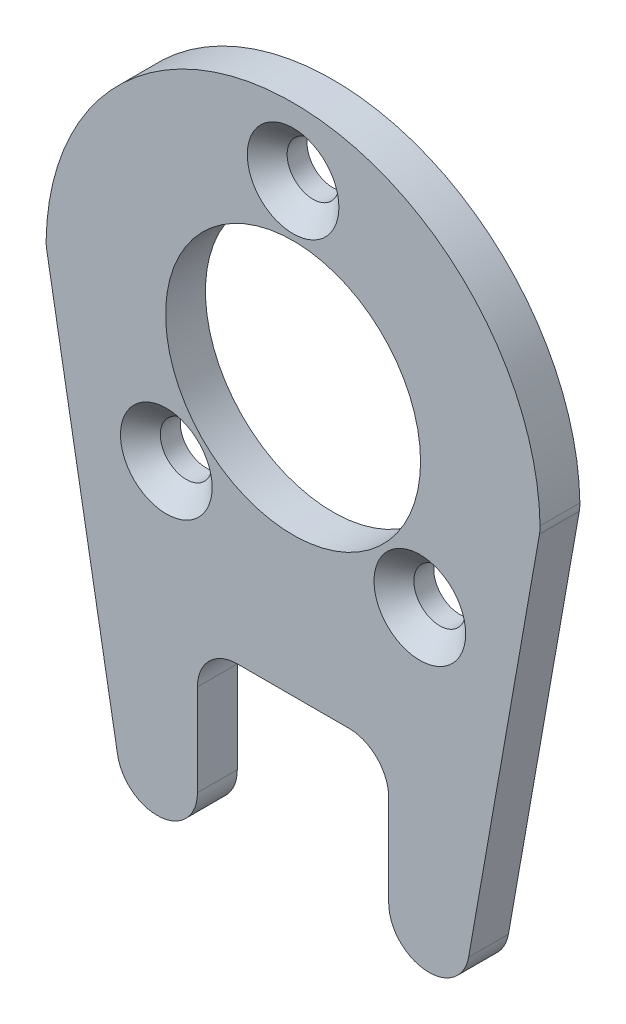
ISO-10303-21;
HEADER;
FILE_DESCRIPTION(('STEP AP214'),'2;1');
FILE_NAME('part.step','',(''),(''),'','','');
FILE_SCHEMA(('AUTOMOTIVE_DESIGN { 1 0 10303 214 1 1 1 1 }'));
ENDSEC;
DATA;
#1=APPLICATION_CONTEXT('core data for automotive mechanical design processes');
#2=APPLICATION_PROTOCOL_DEFINITION('international standard','automotive_design',2000,#1);
#3=PRODUCT_CONTEXT('',#1,'mechanical');
#4=PRODUCT('Part','Part','',(#3));
#5=PRODUCT_RELATED_PRODUCT_CATEGORY('part','',(#4));
#6=PRODUCT_DEFINITION_FORMATION('','',#4);
#7=PRODUCT_DEFINITION_CONTEXT('part definition',#1,'design');
#8=PRODUCT_DEFINITION('design','',#6,#7);
#9=PRODUCT_DEFINITION_SHAPE('','',#8);
#10=(LENGTH_UNIT() NAMED_UNIT(*) SI_UNIT(.MILLI.,.METRE.));
#11=(NAMED_UNIT(*) PLANE_ANGLE_UNIT() SI_UNIT($,.RADIAN.));
#12=(NAMED_UNIT(*) SI_UNIT($,.STERADIAN.) SOLID_ANGLE_UNIT());
#13=UNCERTAINTY_MEASURE_WITH_UNIT(LENGTH_MEASURE(1.E-05),#10,'distance_accuracy_value','');
#14=(GEOMETRIC_REPRESENTATION_CONTEXT(3) GLOBAL_UNCERTAINTY_ASSIGNED_CONTEXT((#13)) GLOBAL_UNIT_ASSIGNED_CONTEXT((#10,
#11,#12)) REPRESENTATION_CONTEXT('',''));
#15=CARTESIAN_POINT('',(0.,0.,0.));
#16=DIRECTION('',(0.,0.,1.));
#17=DIRECTION('',(1.,0.,0.));
#18=AXIS2_PLACEMENT_3D('',#15,#16,#17);
#19=CARTESIAN_POINT('',(25.7226455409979,0.868240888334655,5.));
#20=DIRECTION('',(0.,0.,1.));
#21=DIRECTION('',(1.,0.,0.));
#22=AXIS2_PLACEMENT_3D('',#19,#20,#21);
#23=PLANE('',#22);
#24=CARTESIAN_POINT('',(15.6359141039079,-15.4600155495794,5.));
#25=DIRECTION('',(0.,0.,1.));
#26=DIRECTION('',(1.,0.,0.));
#27=AXIS2_PLACEMENT_3D('',#24,#25,#26);
#28=CIRCLE('',#27,5.75000000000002);
#29=CARTESIAN_POINT('',(21.3859141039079,-15.4600155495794,5.));
#30=VERTEX_POINT('',#29);
#31=EDGE_CURVE('E279',#30,#30,#28,.F.);
#32=ORIENTED_EDGE('',*,*,#31,.T.);
#33=EDGE_LOOP('',(#32));
#34=FACE_BOUND('',#33,.T.);
#35=CARTESIAN_POINT('',(-16.1838910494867,-15.4600155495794,5.));
#36=DIRECTION('',(0.,0.,1.));
#37=DIRECTION('',(1.,0.,0.));
#38=AXIS2_PLACEMENT_3D('',#35,#36,#37);
#39=CIRCLE('',#38,5.75000000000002);
#40=CARTESIAN_POINT('',(-10.4338910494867,-15.4600155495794,5.));
#41=VERTEX_POINT('',#40);
#42=EDGE_CURVE('E276',#41,#41,#39,.F.);
#43=ORIENTED_EDGE('',*,*,#42,.T.);
#44=EDGE_LOOP('',(#43));
#45=FACE_BOUND('',#44,.T.);
#46=CARTESIAN_POINT('',(-0.273988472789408,22.9498870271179,5.));
#47=DIRECTION('',(0.,0.,1.));
#48=DIRECTION('',(1.,0.,0.));
#49=AXIS2_PLACEMENT_3D('',#46,#47,#48);
#50=CIRCLE('',#49,5.75000000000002);
#51=CARTESIAN_POINT('',(5.47601152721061,22.9498870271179,5.));
#52=VERTEX_POINT('',#51);
#53=EDGE_CURVE('E273',#52,#52,#50,.F.);
#54=ORIENTED_EDGE('',*,*,#53,.T.);
#55=EDGE_LOOP('',(#54));
#56=FACE_BOUND('',#55,.T.);
#57=CARTESIAN_POINT('',(-0.273988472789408,0.449887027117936,5.));
#58=DIRECTION('',(0.,0.,1.));
#59=DIRECTION('',(1.,0.,0.));
#60=AXIS2_PLACEMENT_3D('',#57,#58,#59);
#61=CIRCLE('',#60,16.);
#62=CARTESIAN_POINT('',(15.7260115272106,0.449887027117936,5.));
#63=VERTEX_POINT('',#62);
#64=EDGE_CURVE('E167',#63,#63,#61,.T.);
#65=ORIENTED_EDGE('',*,*,#64,.F.);
#66=EDGE_LOOP('',(#65));
#67=FACE_BOUND('',#66,.T.);
#68=CARTESIAN_POINT('',(25.7226455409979,0.868240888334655,5.));
#69=DIRECTION('',(0.,0.,1.));
#70=DIRECTION('',(1.,0.,0.));
#71=AXIS2_PLACEMENT_3D('',#68,#69,#70);
#72=CIRCLE('',#71,5.);
#73=CARTESIAN_POINT('',(30.646684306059,0.,5.));
#74=VERTEX_POINT('',#73);
#75=CARTESIAN_POINT('',(30.721998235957,0.948693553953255,5.));
#76=VERTEX_POINT('',#75);
#77=EDGE_CURVE('E201',#74,#76,#72,.T.);
#78=ORIENTED_EDGE('',*,*,#77,.T.);
#79=CARTESIAN_POINT('',(-0.273988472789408,0.449887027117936,5.));
#80=DIRECTION('',(0.,0.,1.));
#81=DIRECTION('',(1.,0.,0.));
#82=AXIS2_PLACEMENT_3D('',#79,#80,#81);
#83=CIRCLE('',#82,31.);
#84=CARTESIAN_POINT('',(-31.2699751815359,0.948693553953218,5.));
#85=VERTEX_POINT('',#84);
#86=EDGE_CURVE('E159',#76,#85,#83,.T.);
#87=ORIENTED_EDGE('',*,*,#86,.T.);
#88=CARTESIAN_POINT('',(-26.2706224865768,0.868240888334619,5.));
#89=DIRECTION('',(0.,0.,1.));
#90=DIRECTION('',(1.,0.,0.));
#91=AXIS2_PLACEMENT_3D('',#88,#89,#90);
#92=CIRCLE('',#91,5.);
#93=CARTESIAN_POINT('',(-31.1946612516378,0.,5.));
#94=VERTEX_POINT('',#93);
#95=EDGE_CURVE('E204',#85,#94,#92,.T.);
#96=ORIENTED_EDGE('',*,*,#95,.T.);
#97=DIRECTION('',(0.173648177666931,-0.984807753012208,0.));
#98=VECTOR('',#97,1.);
#99=CARTESIAN_POINT('',(-22.3045451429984,-50.4183538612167,5.));
#100=LINE('',#99,#98);
#101=CARTESIAN_POINT('',(-22.3045451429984,-50.4183538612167,5.));
#102=VERTEX_POINT('',#101);
#103=EDGE_CURVE('E206',#94,#102,#100,.T.);
#104=ORIENTED_EDGE('',*,*,#103,.T.);
#105=CARTESIAN_POINT('',(-17.3805063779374,-49.5501129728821,5.));
#106=DIRECTION('',(0.,0.,1.));
#107=DIRECTION('',(1.,0.,0.));
#108=AXIS2_PLACEMENT_3D('',#105,#106,#107);
#109=CIRCLE('',#108,5.00000000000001);
#110=CARTESIAN_POINT('',(-17.3805063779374,-54.5501129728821,5.));
#111=VERTEX_POINT('',#110);
#112=EDGE_CURVE('E208',#102,#111,#109,.T.);
#113=ORIENTED_EDGE('',*,*,#112,.T.);
#114=DIRECTION('',(1.,0.,0.));
#115=VECTOR('',#114,1.);
#116=CARTESIAN_POINT('',(-17.3805063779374,-54.5501129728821,5.));
#117=LINE('',#116,#115);
#118=CARTESIAN_POINT('',(-17.2739884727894,-54.5501129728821,5.));
#119=VERTEX_POINT('',#118);
#120=EDGE_CURVE('E210',#111,#119,#117,.T.);
#121=ORIENTED_EDGE('',*,*,#120,.T.);
#122=CARTESIAN_POINT('',(-17.2739884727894,-49.5501129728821,5.));
#123=DIRECTION('',(0.,0.,1.));
#124=DIRECTION('',(1.,0.,0.));
#125=AXIS2_PLACEMENT_3D('',#122,#123,#124);
#126=CIRCLE('',#125,5.);
#127=CARTESIAN_POINT('',(-12.2739884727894,-49.5501129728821,5.));
#128=VERTEX_POINT('',#127);
#129=EDGE_CURVE('E212',#119,#128,#126,.T.);
#130=ORIENTED_EDGE('',*,*,#129,.T.);
#131=DIRECTION('',(0.,1.,0.));
#132=VECTOR('',#131,1.);
#133=CARTESIAN_POINT('',(-12.2739884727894,-38.0501129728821,5.));
#134=LINE('',#133,#132);
#135=CARTESIAN_POINT('',(-12.2739884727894,-38.0501129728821,5.));
#136=VERTEX_POINT('',#135);
#137=EDGE_CURVE('E214',#128,#136,#134,.T.);
#138=ORIENTED_EDGE('',*,*,#137,.T.);
#139=CARTESIAN_POINT('',(-7.27398847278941,-38.0501129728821,5.));
#140=DIRECTION('',(0.,0.,-1.));
#141=DIRECTION('',(1.,0.,0.));
#142=AXIS2_PLACEMENT_3D('',#139,#140,#141);
#143=CIRCLE('',#142,5.);
#144=CARTESIAN_POINT('',(-7.27398847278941,-33.0501129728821,5.));
#145=VERTEX_POINT('',#144);
#146=EDGE_CURVE('E216',#136,#145,#143,.T.);
#147=ORIENTED_EDGE('',*,*,#146,.T.);
#148=DIRECTION('',(1.,0.,0.));
#149=VECTOR('',#148,1.);
#150=CARTESIAN_POINT('',(6.72601152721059,-33.0501129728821,5.));
#151=LINE('',#150,#149);
#152=CARTESIAN_POINT('',(6.72601152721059,-33.0501129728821,5.));
#153=VERTEX_POINT('',#152);
#154=EDGE_CURVE('E218',#145,#153,#151,.T.);
#155=ORIENTED_EDGE('',*,*,#154,.T.);
#156=CARTESIAN_POINT('',(6.72601152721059,-38.0501129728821,5.));
#157=DIRECTION('',(0.,0.,-1.));
#158=DIRECTION('',(1.,0.,0.));
#159=AXIS2_PLACEMENT_3D('',#156,#157,#158);
#160=CIRCLE('',#159,5.);
#161=CARTESIAN_POINT('',(11.7260115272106,-38.0501129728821,5.));
#162=VERTEX_POINT('',#161);
#163=EDGE_CURVE('E220',#153,#162,#160,.T.);
#164=ORIENTED_EDGE('',*,*,#163,.T.);
#165=DIRECTION('',(0.,-1.,0.));
#166=VECTOR('',#165,1.);
#167=CARTESIAN_POINT('',(11.7260115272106,-49.5501129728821,5.));
#168=LINE('',#167,#166);
#169=CARTESIAN_POINT('',(11.7260115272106,-49.5501129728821,5.));
#170=VERTEX_POINT('',#169);
#171=EDGE_CURVE('E222',#162,#170,#168,.T.);
#172=ORIENTED_EDGE('',*,*,#171,.T.);
#173=CARTESIAN_POINT('',(16.7260115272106,-49.5501129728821,5.));
#174=DIRECTION('',(0.,0.,1.));
#175=DIRECTION('',(1.,0.,0.));
#176=AXIS2_PLACEMENT_3D('',#173,#174,#175);
#177=CIRCLE('',#176,4.99999999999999);
#178=CARTESIAN_POINT('',(16.7260115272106,-54.5501129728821,5.));
#179=VERTEX_POINT('',#178);
#180=EDGE_CURVE('E224',#170,#179,#177,.T.);
#181=ORIENTED_EDGE('',*,*,#180,.T.);
#182=DIRECTION('',(1.,0.,0.));
#183=VECTOR('',#182,1.);
#184=CARTESIAN_POINT('',(16.7260115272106,-54.5501129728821,5.));
#185=LINE('',#184,#183);
#186=CARTESIAN_POINT('',(16.8325294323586,-54.5501129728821,5.));
#187=VERTEX_POINT('',#186);
#188=EDGE_CURVE('E226',#179,#187,#185,.T.);
#189=ORIENTED_EDGE('',*,*,#188,.T.);
#190=CARTESIAN_POINT('',(16.8325294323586,-49.5501129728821,5.));
#191=DIRECTION('',(0.,0.,1.));
#192=DIRECTION('',(1.,0.,0.));
#193=AXIS2_PLACEMENT_3D('',#190,#191,#192);
#194=CIRCLE('',#193,4.99999999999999);
#195=CARTESIAN_POINT('',(21.7565681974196,-50.4183538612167,5.));
#196=VERTEX_POINT('',#195);
#197=EDGE_CURVE('E50',#187,#196,#194,.T.);
#198=ORIENTED_EDGE('',*,*,#197,.T.);
#199=DIRECTION('',(0.173648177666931,0.984807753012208,0.));
#200=VECTOR('',#199,1.);
#201=CARTESIAN_POINT('',(30.646684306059,0.,5.));
#202=LINE('',#201,#200);
#203=EDGE_CURVE('E45',#196,#74,#202,.T.);
#204=ORIENTED_EDGE('',*,*,#203,.T.);
#205=EDGE_LOOP('',(#78,#87,#96,#104,#113,#121,#130,#138,#147,#155,#164,#172,#181,#189,#198,#204));
#206=FACE_BOUND('',#205,.T.);
#207=ADVANCED_FACE('F30',(#34,#45,#56,#67,#206),#23,.T.);
#208=CARTESIAN_POINT('',(25.7226455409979,0.868240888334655,0.));
#209=DIRECTION('',(0.,0.,1.));
#210=DIRECTION('',(1.,0.,0.));
#211=AXIS2_PLACEMENT_3D('',#208,#209,#210);
#212=PLANE('',#211);
#213=CARTESIAN_POINT('',(-16.1838910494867,-15.4600155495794,0.));
#214=DIRECTION('',(0.,0.,1.));
#215=DIRECTION('',(1.,0.,0.));
#216=AXIS2_PLACEMENT_3D('',#213,#214,#215);
#217=CIRCLE('',#216,3.25);
#218=CARTESIAN_POINT('',(-12.9338910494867,-15.4600155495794,0.));
#219=VERTEX_POINT('',#218);
#220=EDGE_CURVE('E534',#219,#219,#217,.T.);
#221=ORIENTED_EDGE('',*,*,#220,.T.);
#222=EDGE_LOOP('',(#221));
#223=FACE_BOUND('',#222,.T.);
#224=CARTESIAN_POINT('',(-0.273988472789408,0.449887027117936,0.));
#225=DIRECTION('',(0.,0.,1.));
#226=DIRECTION('',(1.,0.,0.));
#227=AXIS2_PLACEMENT_3D('',#224,#225,#226);
#228=CIRCLE('',#227,16.);
#229=CARTESIAN_POINT('',(15.7260115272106,0.449887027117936,0.));
#230=VERTEX_POINT('',#229);
#231=EDGE_CURVE('E170',#230,#230,#228,.T.);
#232=ORIENTED_EDGE('',*,*,#231,.T.);
#233=EDGE_LOOP('',(#232));
#234=FACE_BOUND('',#233,.T.);
#235=CARTESIAN_POINT('',(25.7226455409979,0.868240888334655,0.));
#236=DIRECTION('',(0.,0.,1.));
#237=DIRECTION('',(1.,0.,0.));
#238=AXIS2_PLACEMENT_3D('',#235,#236,#237);
#239=CIRCLE('',#238,5.);
#240=CARTESIAN_POINT('',(30.646684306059,0.,0.));
#241=VERTEX_POINT('',#240);
#242=CARTESIAN_POINT('',(30.721998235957,0.948693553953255,0.));
#243=VERTEX_POINT('',#242);
#244=EDGE_CURVE('E149',#241,#243,#239,.T.);
#245=ORIENTED_EDGE('',*,*,#244,.F.);
#246=DIRECTION('',(0.173648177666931,0.984807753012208,0.));
#247=VECTOR('',#246,1.);
#248=CARTESIAN_POINT('',(30.646684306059,0.,0.));
#249=LINE('',#248,#247);
#250=CARTESIAN_POINT('',(21.7565681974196,-50.4183538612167,0.));
#251=VERTEX_POINT('',#250);
#252=EDGE_CURVE('E199',#251,#241,#249,.T.);
#253=ORIENTED_EDGE('',*,*,#252,.F.);
#254=CARTESIAN_POINT('',(16.8325294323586,-49.5501129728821,0.));
#255=DIRECTION('',(0.,0.,1.));
#256=DIRECTION('',(1.,0.,0.));
#257=AXIS2_PLACEMENT_3D('',#254,#255,#256);
#258=CIRCLE('',#257,4.99999999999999);
#259=CARTESIAN_POINT('',(16.8325294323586,-54.5501129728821,0.));
#260=VERTEX_POINT('',#259);
#261=EDGE_CURVE('E197',#260,#251,#258,.T.);
#262=ORIENTED_EDGE('',*,*,#261,.F.);
#263=DIRECTION('',(1.,0.,0.));
#264=VECTOR('',#263,1.);
#265=CARTESIAN_POINT('',(16.7260115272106,-54.5501129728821,0.));
#266=LINE('',#265,#264);
#267=CARTESIAN_POINT('',(16.7260115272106,-54.5501129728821,0.));
#268=VERTEX_POINT('',#267);
#269=EDGE_CURVE('E195',#268,#260,#266,.T.);
#270=ORIENTED_EDGE('',*,*,#269,.F.);
#271=CARTESIAN_POINT('',(16.7260115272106,-49.5501129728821,0.));
#272=DIRECTION('',(0.,0.,1.));
#273=DIRECTION('',(1.,0.,0.));
#274=AXIS2_PLACEMENT_3D('',#271,#272,#273);
#275=CIRCLE('',#274,4.99999999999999);
#276=CARTESIAN_POINT('',(11.7260115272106,-49.5501129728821,0.));
#277=VERTEX_POINT('',#276);
#278=EDGE_CURVE('E193',#277,#268,#275,.T.);
#279=ORIENTED_EDGE('',*,*,#278,.F.);
#280=DIRECTION('',(0.,-1.,0.));
#281=VECTOR('',#280,1.);
#282=CARTESIAN_POINT('',(11.7260115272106,-49.5501129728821,0.));
#283=LINE('',#282,#281);
#284=CARTESIAN_POINT('',(11.7260115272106,-38.0501129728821,0.));
#285=VERTEX_POINT('',#284);
#286=EDGE_CURVE('E191',#285,#277,#283,.T.);
#287=ORIENTED_EDGE('',*,*,#286,.F.);
#288=CARTESIAN_POINT('',(6.72601152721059,-38.0501129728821,0.));
#289=DIRECTION('',(0.,0.,-1.));
#290=DIRECTION('',(1.,0.,0.));
#291=AXIS2_PLACEMENT_3D('',#288,#289,#290);
#292=CIRCLE('',#291,5.);
#293=CARTESIAN_POINT('',(6.72601152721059,-33.0501129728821,0.));
#294=VERTEX_POINT('',#293);
#295=EDGE_CURVE('E189',#294,#285,#292,.T.);
#296=ORIENTED_EDGE('',*,*,#295,.F.);
#297=DIRECTION('',(1.,0.,0.));
#298=VECTOR('',#297,1.);
#299=CARTESIAN_POINT('',(6.72601152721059,-33.0501129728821,0.));
#300=LINE('',#299,#298);
#301=CARTESIAN_POINT('',(-7.27398847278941,-33.0501129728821,0.));
#302=VERTEX_POINT('',#301);
#303=EDGE_CURVE('E187',#302,#294,#300,.T.);
#304=ORIENTED_EDGE('',*,*,#303,.F.);
#305=CARTESIAN_POINT('',(-7.27398847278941,-38.0501129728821,0.));
#306=DIRECTION('',(0.,0.,-1.));
#307=DIRECTION('',(1.,0.,0.));
#308=AXIS2_PLACEMENT_3D('',#305,#306,#307);
#309=CIRCLE('',#308,5.);
#310=CARTESIAN_POINT('',(-12.2739884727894,-38.0501129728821,0.));
#311=VERTEX_POINT('',#310);
#312=EDGE_CURVE('E185',#311,#302,#309,.T.);
#313=ORIENTED_EDGE('',*,*,#312,.F.);
#314=DIRECTION('',(0.,1.,0.));
#315=VECTOR('',#314,1.);
#316=CARTESIAN_POINT('',(-12.2739884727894,-38.0501129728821,0.));
#317=LINE('',#316,#315);
#318=CARTESIAN_POINT('',(-12.2739884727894,-49.5501129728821,0.));
#319=VERTEX_POINT('',#318);
#320=EDGE_CURVE('E183',#319,#311,#317,.T.);
#321=ORIENTED_EDGE('',*,*,#320,.F.);
#322=CARTESIAN_POINT('',(-17.2739884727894,-49.5501129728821,0.));
#323=DIRECTION('',(0.,0.,1.));
#324=DIRECTION('',(1.,0.,0.));
#325=AXIS2_PLACEMENT_3D('',#322,#323,#324);
#326=CIRCLE('',#325,5.);
#327=CARTESIAN_POINT('',(-17.2739884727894,-54.5501129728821,0.));
#328=VERTEX_POINT('',#327);
#329=EDGE_CURVE('E181',#328,#319,#326,.T.);
#330=ORIENTED_EDGE('',*,*,#329,.F.);
#331=DIRECTION('',(1.,0.,0.));
#332=VECTOR('',#331,1.);
#333=CARTESIAN_POINT('',(-17.3805063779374,-54.5501129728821,0.));
#334=LINE('',#333,#332);
#335=CARTESIAN_POINT('',(-17.3805063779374,-54.5501129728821,0.));
#336=VERTEX_POINT('',#335);
#337=EDGE_CURVE('E179',#336,#328,#334,.T.);
#338=ORIENTED_EDGE('',*,*,#337,.F.);
#339=CARTESIAN_POINT('',(-17.3805063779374,-49.5501129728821,0.));
#340=DIRECTION('',(0.,0.,1.));
#341=DIRECTION('',(1.,0.,0.));
#342=AXIS2_PLACEMENT_3D('',#339,#340,#341);
#343=CIRCLE('',#342,5.00000000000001);
#344=CARTESIAN_POINT('',(-22.3045451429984,-50.4183538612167,0.));
#345=VERTEX_POINT('',#344);
#346=EDGE_CURVE('E177',#345,#336,#343,.T.);
#347=ORIENTED_EDGE('',*,*,#346,.F.);
#348=DIRECTION('',(0.173648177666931,-0.984807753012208,0.));
#349=VECTOR('',#348,1.);
#350=CARTESIAN_POINT('',(-22.3045451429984,-50.4183538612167,0.));
#351=LINE('',#350,#349);
#352=CARTESIAN_POINT('',(-31.1946612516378,0.,0.));
#353=VERTEX_POINT('',#352);
#354=EDGE_CURVE('E175',#353,#345,#351,.T.);
#355=ORIENTED_EDGE('',*,*,#354,.F.);
#356=CARTESIAN_POINT('',(-26.2706224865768,0.868240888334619,0.));
#357=DIRECTION('',(0.,0.,1.));
#358=DIRECTION('',(1.,0.,0.));
#359=AXIS2_PLACEMENT_3D('',#356,#357,#358);
#360=CIRCLE('',#359,5.);
#361=CARTESIAN_POINT('',(-31.2699751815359,0.948693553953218,0.));
#362=VERTEX_POINT('',#361);
#363=EDGE_CURVE('E151',#362,#353,#360,.T.);
#364=ORIENTED_EDGE('',*,*,#363,.F.);
#365=CARTESIAN_POINT('',(-0.273988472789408,0.449887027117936,0.));
#366=DIRECTION('',(0.,0.,1.));
#367=DIRECTION('',(1.,0.,0.));
#368=AXIS2_PLACEMENT_3D('',#365,#366,#367);
#369=CIRCLE('',#368,31.);
#370=EDGE_CURVE('E143',#243,#362,#369,.T.);
#371=ORIENTED_EDGE('',*,*,#370,.F.);
#372=EDGE_LOOP('',(#245,#253,#262,#270,#279,#287,#296,#304,#313,#321,#330,#338,#347,#355,#364,#371));
#373=FACE_BOUND('',#372,.T.);
#374=CARTESIAN_POINT('',(-0.273988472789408,22.9498870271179,0.));
#375=DIRECTION('',(0.,0.,1.));
#376=DIRECTION('',(1.,0.,0.));
#377=AXIS2_PLACEMENT_3D('',#374,#375,#376);
#378=CIRCLE('',#377,3.25);
#379=CARTESIAN_POINT('',(2.97601152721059,22.9498870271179,0.));
#380=VERTEX_POINT('',#379);
#381=EDGE_CURVE('E537',#380,#380,#378,.T.);
#382=ORIENTED_EDGE('',*,*,#381,.T.);
#383=EDGE_LOOP('',(#382));
#384=FACE_BOUND('',#383,.T.);
#385=CARTESIAN_POINT('',(15.6359141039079,-15.4600155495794,0.));
#386=DIRECTION('',(0.,0.,1.));
#387=DIRECTION('',(1.,0.,0.));
#388=AXIS2_PLACEMENT_3D('',#385,#386,#387);
#389=CIRCLE('',#388,3.25);
#390=CARTESIAN_POINT('',(18.8859141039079,-15.4600155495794,0.));
#391=VERTEX_POINT('',#390);
#392=EDGE_CURVE('E532',#391,#391,#389,.T.);
#393=ORIENTED_EDGE('',*,*,#392,.T.);
#394=EDGE_LOOP('',(#393));
#395=FACE_BOUND('',#394,.T.);
#396=ADVANCED_FACE('F145',(#223,#234,#373,#384,#395),#212,.F.);
#397=CARTESIAN_POINT('',(25.7226455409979,0.868240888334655,5.));
#398=DIRECTION('',(0.,0.,-1.));
#399=DIRECTION('',(-1.,0.,0.));
#400=AXIS2_PLACEMENT_3D('',#397,#398,#399);
#401=CYLINDRICAL_SURFACE('',#400,5.);
#402=ORIENTED_EDGE('',*,*,#244,.T.);
#403=DIRECTION('',(0.,0.,-1.));
#404=VECTOR('',#403,1.);
#405=CARTESIAN_POINT('',(30.721998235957,0.948693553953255,5.));
#406=LINE('',#405,#404);
#407=EDGE_CURVE('E157',#76,#243,#406,.T.);
#408=ORIENTED_EDGE('',*,*,#407,.F.);
#409=ORIENTED_EDGE('',*,*,#77,.F.);
#410=DIRECTION('',(0.,0.,-1.));
#411=VECTOR('',#410,1.);
#412=CARTESIAN_POINT('',(30.646684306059,0.,5.));
#413=LINE('',#412,#411);
#414=EDGE_CURVE('E166',#74,#241,#413,.T.);
#415=ORIENTED_EDGE('',*,*,#414,.T.);
#416=EDGE_LOOP('',(#402,#408,#409,#415));
#417=FACE_BOUND('',#416,.T.);
#418=ADVANCED_FACE('F32',(#417),#401,.T.);
#419=CARTESIAN_POINT('',(-0.273988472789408,0.449887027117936,5.));
#420=DIRECTION('',(0.,0.,-1.));
#421=DIRECTION('',(-1.,0.,0.));
#422=AXIS2_PLACEMENT_3D('',#419,#420,#421);
#423=CYLINDRICAL_SURFACE('',#422,31.);
#424=ORIENTED_EDGE('',*,*,#370,.T.);
#425=DIRECTION('',(0.,0.,-1.));
#426=VECTOR('',#425,1.);
#427=CARTESIAN_POINT('',(-31.2699751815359,0.948693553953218,5.));
#428=LINE('',#427,#426);
#429=EDGE_CURVE('E163',#85,#362,#428,.T.);
#430=ORIENTED_EDGE('',*,*,#429,.F.);
#431=ORIENTED_EDGE('',*,*,#86,.F.);
#432=ORIENTED_EDGE('',*,*,#407,.T.);
#433=EDGE_LOOP('',(#424,#430,#431,#432));
#434=FACE_BOUND('',#433,.T.);
#435=ADVANCED_FACE('F158',(#434),#423,.T.);
#436=CARTESIAN_POINT('',(-26.2706224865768,0.868240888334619,5.));
#437=DIRECTION('',(0.,0.,-1.));
#438=DIRECTION('',(-1.,0.,0.));
#439=AXIS2_PLACEMENT_3D('',#436,#437,#438);
#440=CYLINDRICAL_SURFACE('',#439,5.);
#441=ORIENTED_EDGE('',*,*,#363,.T.);
#442=DIRECTION('',(0.,0.,-1.));
#443=VECTOR('',#442,1.);
#444=CARTESIAN_POINT('',(-31.1946612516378,0.,5.));
#445=LINE('',#444,#443);
#446=EDGE_CURVE('E267',#94,#353,#445,.T.);
#447=ORIENTED_EDGE('',*,*,#446,.F.);
#448=ORIENTED_EDGE('',*,*,#95,.F.);
#449=ORIENTED_EDGE('',*,*,#429,.T.);
#450=EDGE_LOOP('',(#441,#447,#448,#449));
#451=FACE_BOUND('',#450,.T.);
#452=ADVANCED_FACE('F366',(#451),#440,.T.);
#453=CARTESIAN_POINT('',(-22.3045451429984,-50.4183538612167,5.));
#454=DIRECTION('',(0.984807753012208,0.173648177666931,0.));
#455=DIRECTION('',(-0.173648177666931,0.984807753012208,0.));
#456=AXIS2_PLACEMENT_3D('',#453,#454,#455);
#457=PLANE('',#456);
#458=ORIENTED_EDGE('',*,*,#354,.T.);
#459=DIRECTION('',(0.,0.,-1.));
#460=VECTOR('',#459,1.);
#461=CARTESIAN_POINT('',(-22.3045451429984,-50.4183538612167,5.));
#462=LINE('',#461,#460);
#463=EDGE_CURVE('E264',#102,#345,#462,.T.);
#464=ORIENTED_EDGE('',*,*,#463,.F.);
#465=ORIENTED_EDGE('',*,*,#103,.F.);
#466=ORIENTED_EDGE('',*,*,#446,.T.);
#467=EDGE_LOOP('',(#458,#464,#465,#466));
#468=FACE_BOUND('',#467,.T.);
#469=ADVANCED_FACE('F362',(#468),#457,.F.);
#470=CARTESIAN_POINT('',(-17.3805063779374,-49.5501129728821,5.));
#471=DIRECTION('',(0.,0.,-1.));
#472=DIRECTION('',(-1.,0.,0.));
#473=AXIS2_PLACEMENT_3D('',#470,#471,#472);
#474=CYLINDRICAL_SURFACE('',#473,5.00000000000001);
#475=ORIENTED_EDGE('',*,*,#346,.T.);
#476=DIRECTION('',(0.,0.,-1.));
#477=VECTOR('',#476,1.);
#478=CARTESIAN_POINT('',(-17.3805063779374,-54.5501129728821,5.));
#479=LINE('',#478,#477);
#480=EDGE_CURVE('E261',#111,#336,#479,.T.);
#481=ORIENTED_EDGE('',*,*,#480,.F.);
#482=ORIENTED_EDGE('',*,*,#112,.F.);
#483=ORIENTED_EDGE('',*,*,#463,.T.);
#484=EDGE_LOOP('',(#475,#481,#482,#483));
#485=FACE_BOUND('',#484,.T.);
#486=ADVANCED_FACE('F358',(#485),#474,.T.);
#487=CARTESIAN_POINT('',(-17.3805063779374,-54.5501129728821,5.));
#488=DIRECTION('',(0.,1.,0.));
#489=DIRECTION('',(0.,0.,1.));
#490=AXIS2_PLACEMENT_3D('',#487,#488,#489);
#491=PLANE('',#490);
#492=ORIENTED_EDGE('',*,*,#337,.T.);
#493=DIRECTION('',(0.,0.,-1.));
#494=VECTOR('',#493,1.);
#495=CARTESIAN_POINT('',(-17.2739884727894,-54.5501129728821,5.));
#496=LINE('',#495,#494);
#497=EDGE_CURVE('E258',#119,#328,#496,.T.);
#498=ORIENTED_EDGE('',*,*,#497,.F.);
#499=ORIENTED_EDGE('',*,*,#120,.F.);
#500=ORIENTED_EDGE('',*,*,#480,.T.);
#501=EDGE_LOOP('',(#492,#498,#499,#500));
#502=FACE_BOUND('',#501,.T.);
#503=ADVANCED_FACE('F354',(#502),#491,.F.);
#504=CARTESIAN_POINT('',(-17.2739884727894,-49.5501129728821,5.));
#505=DIRECTION('',(0.,0.,-1.));
#506=DIRECTION('',(-1.,0.,0.));
#507=AXIS2_PLACEMENT_3D('',#504,#505,#506);
#508=CYLINDRICAL_SURFACE('',#507,5.);
#509=ORIENTED_EDGE('',*,*,#329,.T.);
#510=DIRECTION('',(0.,0.,-1.));
#511=VECTOR('',#510,1.);
#512=CARTESIAN_POINT('',(-12.2739884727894,-49.5501129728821,5.));
#513=LINE('',#512,#511);
#514=EDGE_CURVE('E255',#128,#319,#513,.T.);
#515=ORIENTED_EDGE('',*,*,#514,.F.);
#516=ORIENTED_EDGE('',*,*,#129,.F.);
#517=ORIENTED_EDGE('',*,*,#497,.T.);
#518=EDGE_LOOP('',(#509,#515,#516,#517));
#519=FACE_BOUND('',#518,.T.);
#520=ADVANCED_FACE('F350',(#519),#508,.T.);
#521=CARTESIAN_POINT('',(-12.2739884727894,-38.0501129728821,5.));
#522=DIRECTION('',(-1.,0.,0.));
#523=DIRECTION('',(0.,-1.,0.));
#524=AXIS2_PLACEMENT_3D('',#521,#522,#523);
#525=PLANE('',#524);
#526=ORIENTED_EDGE('',*,*,#320,.T.);
#527=DIRECTION('',(0.,0.,-1.));
#528=VECTOR('',#527,1.);
#529=CARTESIAN_POINT('',(-12.2739884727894,-38.0501129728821,5.));
#530=LINE('',#529,#528);
#531=EDGE_CURVE('E252',#136,#311,#530,.T.);
#532=ORIENTED_EDGE('',*,*,#531,.F.);
#533=ORIENTED_EDGE('',*,*,#137,.F.);
#534=ORIENTED_EDGE('',*,*,#514,.T.);
#535=EDGE_LOOP('',(#526,#532,#533,#534));
#536=FACE_BOUND('',#535,.T.);
#537=ADVANCED_FACE('F346',(#536),#525,.F.);
#538=CARTESIAN_POINT('',(-7.27398847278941,-38.0501129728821,5.));
#539=DIRECTION('',(0.,0.,-1.));
#540=DIRECTION('',(-1.,0.,0.));
#541=AXIS2_PLACEMENT_3D('',#538,#539,#540);
#542=CYLINDRICAL_SURFACE('',#541,5.);
#543=ORIENTED_EDGE('',*,*,#312,.T.);
#544=DIRECTION('',(0.,0.,-1.));
#545=VECTOR('',#544,1.);
#546=CARTESIAN_POINT('',(-7.27398847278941,-33.0501129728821,5.));
#547=LINE('',#546,#545);
#548=EDGE_CURVE('E249',#145,#302,#547,.T.);
#549=ORIENTED_EDGE('',*,*,#548,.F.);
#550=ORIENTED_EDGE('',*,*,#146,.F.);
#551=ORIENTED_EDGE('',*,*,#531,.T.);
#552=EDGE_LOOP('',(#543,#549,#550,#551));
#553=FACE_BOUND('',#552,.T.);
#554=ADVANCED_FACE('F342',(#553),#542,.F.);
#555=CARTESIAN_POINT('',(6.72601152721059,-33.0501129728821,5.));
#556=DIRECTION('',(0.,1.,0.));
#557=DIRECTION('',(0.,0.,1.));
#558=AXIS2_PLACEMENT_3D('',#555,#556,#557);
#559=PLANE('',#558);
#560=ORIENTED_EDGE('',*,*,#303,.T.);
#561=DIRECTION('',(0.,0.,-1.));
#562=VECTOR('',#561,1.);
#563=CARTESIAN_POINT('',(6.72601152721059,-33.0501129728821,5.));
#564=LINE('',#563,#562);
#565=EDGE_CURVE('E246',#153,#294,#564,.T.);
#566=ORIENTED_EDGE('',*,*,#565,.F.);
#567=ORIENTED_EDGE('',*,*,#154,.F.);
#568=ORIENTED_EDGE('',*,*,#548,.T.);
#569=EDGE_LOOP('',(#560,#566,#567,#568));
#570=FACE_BOUND('',#569,.T.);
#571=ADVANCED_FACE('F338',(#570),#559,.F.);
#572=CARTESIAN_POINT('',(6.72601152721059,-38.0501129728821,5.));
#573=DIRECTION('',(0.,0.,-1.));
#574=DIRECTION('',(-1.,0.,0.));
#575=AXIS2_PLACEMENT_3D('',#572,#573,#574);
#576=CYLINDRICAL_SURFACE('',#575,5.);
#577=ORIENTED_EDGE('',*,*,#295,.T.);
#578=DIRECTION('',(0.,0.,-1.));
#579=VECTOR('',#578,1.);
#580=CARTESIAN_POINT('',(11.7260115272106,-38.0501129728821,5.));
#581=LINE('',#580,#579);
#582=EDGE_CURVE('E243',#162,#285,#581,.T.);
#583=ORIENTED_EDGE('',*,*,#582,.F.);
#584=ORIENTED_EDGE('',*,*,#163,.F.);
#585=ORIENTED_EDGE('',*,*,#565,.T.);
#586=EDGE_LOOP('',(#577,#583,#584,#585));
#587=FACE_BOUND('',#586,.T.);
#588=ADVANCED_FACE('F334',(#587),#576,.F.);
#589=CARTESIAN_POINT('',(11.7260115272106,-49.5501129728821,5.));
#590=DIRECTION('',(1.,0.,0.));
#591=DIRECTION('',(0.,1.,0.));
#592=AXIS2_PLACEMENT_3D('',#589,#590,#591);
#593=PLANE('',#592);
#594=ORIENTED_EDGE('',*,*,#286,.T.);
#595=DIRECTION('',(0.,0.,-1.));
#596=VECTOR('',#595,1.);
#597=CARTESIAN_POINT('',(11.7260115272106,-49.5501129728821,5.));
#598=LINE('',#597,#596);
#599=EDGE_CURVE('E240',#170,#277,#598,.T.);
#600=ORIENTED_EDGE('',*,*,#599,.F.);
#601=ORIENTED_EDGE('',*,*,#171,.F.);
#602=ORIENTED_EDGE('',*,*,#582,.T.);
#603=EDGE_LOOP('',(#594,#600,#601,#602));
#604=FACE_BOUND('',#603,.T.);
#605=ADVANCED_FACE('F330',(#604),#593,.F.);
#606=CARTESIAN_POINT('',(16.7260115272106,-49.5501129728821,5.));
#607=DIRECTION('',(0.,0.,-1.));
#608=DIRECTION('',(-1.,0.,0.));
#609=AXIS2_PLACEMENT_3D('',#606,#607,#608);
#610=CYLINDRICAL_SURFACE('',#609,4.99999999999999);
#611=ORIENTED_EDGE('',*,*,#278,.T.);
#612=DIRECTION('',(0.,0.,-1.));
#613=VECTOR('',#612,1.);
#614=CARTESIAN_POINT('',(16.7260115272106,-54.5501129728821,5.));
#615=LINE('',#614,#613);
#616=EDGE_CURVE('E237',#179,#268,#615,.T.);
#617=ORIENTED_EDGE('',*,*,#616,.F.);
#618=ORIENTED_EDGE('',*,*,#180,.F.);
#619=ORIENTED_EDGE('',*,*,#599,.T.);
#620=EDGE_LOOP('',(#611,#617,#618,#619));
#621=FACE_BOUND('',#620,.T.);
#622=ADVANCED_FACE('F326',(#621),#610,.T.);
#623=CARTESIAN_POINT('',(16.7260115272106,-54.5501129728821,5.));
#624=DIRECTION('',(0.,1.,0.));
#625=DIRECTION('',(0.,0.,1.));
#626=AXIS2_PLACEMENT_3D('',#623,#624,#625);
#627=PLANE('',#626);
#628=ORIENTED_EDGE('',*,*,#269,.T.);
#629=DIRECTION('',(0.,0.,-1.));
#630=VECTOR('',#629,1.);
#631=CARTESIAN_POINT('',(16.8325294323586,-54.5501129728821,5.));
#632=LINE('',#631,#630);
#633=EDGE_CURVE('E234',#187,#260,#632,.T.);
#634=ORIENTED_EDGE('',*,*,#633,.F.);
#635=ORIENTED_EDGE('',*,*,#188,.F.);
#636=ORIENTED_EDGE('',*,*,#616,.T.);
#637=EDGE_LOOP('',(#628,#634,#635,#636));
#638=FACE_BOUND('',#637,.T.);
#639=ADVANCED_FACE('F322',(#638),#627,.F.);
#640=CARTESIAN_POINT('',(16.8325294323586,-49.5501129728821,5.));
#641=DIRECTION('',(0.,0.,-1.));
#642=DIRECTION('',(-1.,0.,0.));
#643=AXIS2_PLACEMENT_3D('',#640,#641,#642);
#644=CYLINDRICAL_SURFACE('',#643,4.99999999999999);
#645=ORIENTED_EDGE('',*,*,#261,.T.);
#646=DIRECTION('',(0.,0.,-1.));
#647=VECTOR('',#646,1.);
#648=CARTESIAN_POINT('',(21.7565681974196,-50.4183538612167,5.));
#649=LINE('',#648,#647);
#650=EDGE_CURVE('E231',#196,#251,#649,.T.);
#651=ORIENTED_EDGE('',*,*,#650,.F.);
#652=ORIENTED_EDGE('',*,*,#197,.F.);
#653=ORIENTED_EDGE('',*,*,#633,.T.);
#654=EDGE_LOOP('',(#645,#651,#652,#653));
#655=FACE_BOUND('',#654,.T.);
#656=ADVANCED_FACE('F318',(#655),#644,.T.);
#657=CARTESIAN_POINT('',(30.646684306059,0.,5.));
#658=DIRECTION('',(-0.984807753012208,0.173648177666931,0.));
#659=DIRECTION('',(-0.173648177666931,-0.984807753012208,0.));
#660=AXIS2_PLACEMENT_3D('',#657,#658,#659);
#661=PLANE('',#660);
#662=ORIENTED_EDGE('',*,*,#252,.T.);
#663=ORIENTED_EDGE('',*,*,#414,.F.);
#664=ORIENTED_EDGE('',*,*,#203,.F.);
#665=ORIENTED_EDGE('',*,*,#650,.T.);
#666=EDGE_LOOP('',(#662,#663,#664,#665));
#667=FACE_BOUND('',#666,.T.);
#668=ADVANCED_FACE('F314',(#667),#661,.F.);
#669=CARTESIAN_POINT('',(-0.273988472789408,0.449887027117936,5.));
#670=DIRECTION('',(0.,0.,-1.));
#671=DIRECTION('',(-1.,0.,0.));
#672=AXIS2_PLACEMENT_3D('',#669,#670,#671);
#673=CYLINDRICAL_SURFACE('',#672,16.);
#674=ORIENTED_EDGE('',*,*,#64,.T.);
#675=EDGE_LOOP('',(#674));
#676=FACE_BOUND('',#675,.T.);
#677=ORIENTED_EDGE('',*,*,#231,.F.);
#678=EDGE_LOOP('',(#677));
#679=FACE_BOUND('',#678,.T.);
#680=ADVANCED_FACE('F317',(#676,#679),#673,.F.);
#681=CARTESIAN_POINT('',(-0.273988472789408,22.9498870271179,5.));
#682=DIRECTION('',(0.,0.,-1.));
#683=DIRECTION('',(-1.,0.,0.));
#684=AXIS2_PLACEMENT_3D('',#681,#682,#683);
#685=CYLINDRICAL_SURFACE('',#684,3.25);
#686=CARTESIAN_POINT('',(-0.273988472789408,22.9498870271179,2.49999999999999));
#687=DIRECTION('',(0.,0.,1.));
#688=DIRECTION('',(1.,0.,0.));
#689=AXIS2_PLACEMENT_3D('',#686,#687,#688);
#690=CIRCLE('',#689,3.25);
#691=CARTESIAN_POINT('',(2.97601152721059,22.9498870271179,2.49999999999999));
#692=VERTEX_POINT('',#691);
#693=EDGE_CURVE('E11',#692,#692,#690,.T.);
#694=ORIENTED_EDGE('',*,*,#693,.T.);
#695=EDGE_LOOP('',(#694));
#696=FACE_BOUND('',#695,.T.);
#697=ORIENTED_EDGE('',*,*,#381,.F.);
#698=EDGE_LOOP('',(#697));
#699=FACE_BOUND('',#698,.T.);
#700=ADVANCED_FACE('F469',(#696,#699),#685,.F.);
#701=CARTESIAN_POINT('',(-16.1838910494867,-15.4600155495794,5.));
#702=DIRECTION('',(0.,0.,-1.));
#703=DIRECTION('',(-1.,0.,0.));
#704=AXIS2_PLACEMENT_3D('',#701,#702,#703);
#705=CYLINDRICAL_SURFACE('',#704,3.25);
#706=CARTESIAN_POINT('',(-16.1838910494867,-15.4600155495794,2.49999999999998));
#707=DIRECTION('',(0.,0.,1.));
#708=DIRECTION('',(1.,0.,0.));
#709=AXIS2_PLACEMENT_3D('',#706,#707,#708);
#710=CIRCLE('',#709,3.25);
#711=CARTESIAN_POINT('',(-12.9338910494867,-15.4600155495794,2.49999999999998));
#712=VERTEX_POINT('',#711);
#713=EDGE_CURVE('E38',#712,#712,#710,.T.);
#714=ORIENTED_EDGE('',*,*,#713,.T.);
#715=EDGE_LOOP('',(#714));
#716=FACE_BOUND('',#715,.T.);
#717=ORIENTED_EDGE('',*,*,#220,.F.);
#718=EDGE_LOOP('',(#717));
#719=FACE_BOUND('',#718,.T.);
#720=ADVANCED_FACE('F284',(#716,#719),#705,.F.);
#721=CARTESIAN_POINT('',(15.6359141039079,-15.4600155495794,5.));
#722=DIRECTION('',(0.,0.,-1.));
#723=DIRECTION('',(-1.,0.,0.));
#724=AXIS2_PLACEMENT_3D('',#721,#722,#723);
#725=CYLINDRICAL_SURFACE('',#724,3.25);
#726=CARTESIAN_POINT('',(15.6359141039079,-15.4600155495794,2.49999999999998));
#727=DIRECTION('',(0.,0.,1.));
#728=DIRECTION('',(1.,0.,0.));
#729=AXIS2_PLACEMENT_3D('',#726,#727,#728);
#730=CIRCLE('',#729,3.25);
#731=CARTESIAN_POINT('',(18.8859141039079,-15.4600155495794,2.49999999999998));
#732=VERTEX_POINT('',#731);
#733=EDGE_CURVE('E162',#732,#732,#730,.T.);
#734=ORIENTED_EDGE('',*,*,#733,.T.);
#735=EDGE_LOOP('',(#734));
#736=FACE_BOUND('',#735,.T.);
#737=ORIENTED_EDGE('',*,*,#392,.F.);
#738=EDGE_LOOP('',(#737));
#739=FACE_BOUND('',#738,.T.);
#740=ADVANCED_FACE('F299',(#736,#739),#725,.F.);
#741=CARTESIAN_POINT('',(15.6359141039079,-15.4600155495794,2.49999999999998));
#742=DIRECTION('',(0.,0.,1.));
#743=DIRECTION('',(1.,0.,0.));
#744=AXIS2_PLACEMENT_3D('',#741,#742,#743);
#745=CONICAL_SURFACE('',#744,3.25,0.785398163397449);
#746=ORIENTED_EDGE('',*,*,#31,.F.);
#747=EDGE_LOOP('',(#746));
#748=FACE_BOUND('',#747,.T.);
#749=ORIENTED_EDGE('',*,*,#733,.F.);
#750=EDGE_LOOP('',(#749));
#751=FACE_BOUND('',#750,.T.);
#752=ADVANCED_FACE('F290',(#748,#751),#745,.F.);
#753=CARTESIAN_POINT('',(-16.1838910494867,-15.4600155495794,2.49999999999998));
#754=DIRECTION('',(0.,0.,1.));
#755=DIRECTION('',(1.,0.,0.));
#756=AXIS2_PLACEMENT_3D('',#753,#754,#755);
#757=CONICAL_SURFACE('',#756,3.25,0.785398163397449);
#758=ORIENTED_EDGE('',*,*,#42,.F.);
#759=EDGE_LOOP('',(#758));
#760=FACE_BOUND('',#759,.T.);
#761=ORIENTED_EDGE('',*,*,#713,.F.);
#762=EDGE_LOOP('',(#761));
#763=FACE_BOUND('',#762,.T.);
#764=ADVANCED_FACE('F287',(#760,#763),#757,.F.);
#765=CARTESIAN_POINT('',(-0.273988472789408,22.9498870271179,2.49999999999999));
#766=DIRECTION('',(0.,0.,1.));
#767=DIRECTION('',(1.,0.,0.));
#768=AXIS2_PLACEMENT_3D('',#765,#766,#767);
#769=CONICAL_SURFACE('',#768,3.25,0.785398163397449);
#770=ORIENTED_EDGE('',*,*,#53,.F.);
#771=EDGE_LOOP('',(#770));
#772=FACE_BOUND('',#771,.T.);
#773=ORIENTED_EDGE('',*,*,#693,.F.);
#774=EDGE_LOOP('',(#773));
#775=FACE_BOUND('',#774,.T.);
#776=ADVANCED_FACE('F289',(#772,#775),#769,.F.);
#777=CLOSED_SHELL('',(#207,#396,#418,#435,#452,#469,#486,#503,#520,#537,#554,#571,#588,#605,
#622,#639,#656,#668,#680,#700,#720,#740,#752,#764,#776));
#778=MANIFOLD_SOLID_BREP('B2',#777);
#779=ADVANCED_BREP_SHAPE_REPRESENTATION('',(#18,#778),#14);
#780=SHAPE_DEFINITION_REPRESENTATION(#9,#779);
ENDSEC;
END-ISO-10303-21;
